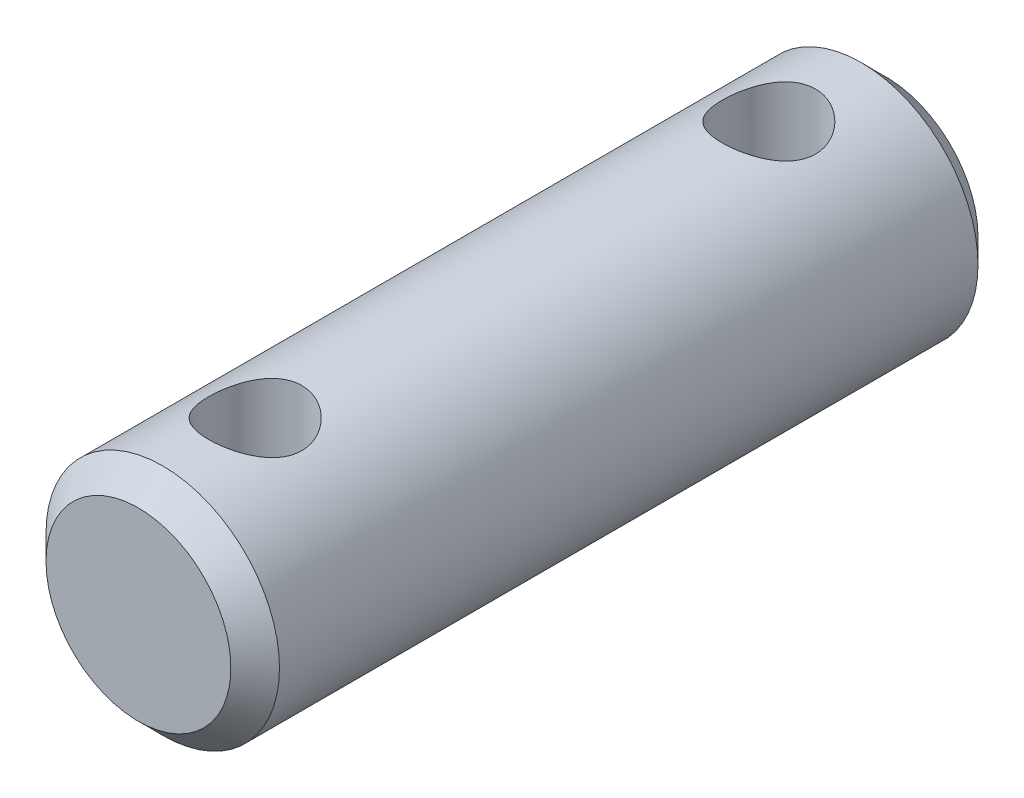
from build123d import *

# Parameters (mm, degrees)
SKETCH1_R               = 3.96875
EXTRUDE1_DEPTH          = 12.7
CHAMFER1_SIZE           = 0.8255
CUT_EXTRUDE1_DEPTH      = 14.8849542
CUT_EXTRUDE1_DEPTH_BACK = 14.8849542
SKETCH2_R               = 1.5875


with BuildPart() as part:
    # Sketch1 → Extrude1 (new, symmetric)
    with BuildSketch(Plane.XY):
        Circle(SKETCH1_R)
    extrude(amount=EXTRUDE1_DEPTH, both=True)

    # Chamfer1
    chamfer1_edges = [part.edges().sort_by_distance(p)[0] for p in [
        (-3.96875, 0, -12.7),
        (-3.96875, 0, 12.7),
    ]]
    chamfer(chamfer1_edges, length=CHAMFER1_SIZE)

    # Sketch2 → Cut-Extrude1 (cut, two sides: drawn at the far end of the back side and taken through both)
    with BuildSketch(Plane(origin=(0, 0, 0), x_dir=(1, 0, 0), z_dir=(0, 1, 0)).offset(-CUT_EXTRUDE1_DEPTH_BACK)):
        with Locations(Location((0, 8.73125, 0), (0, 0, 270))):
            Circle(SKETCH2_R)
        with Locations(Location((0, -8.73125, 0), (0, 0, 270))):
            Circle(SKETCH2_R)
    extrude(amount=CUT_EXTRUDE1_DEPTH + CUT_EXTRUDE1_DEPTH_BACK, mode=Mode.SUBTRACT)


solid = part.part
